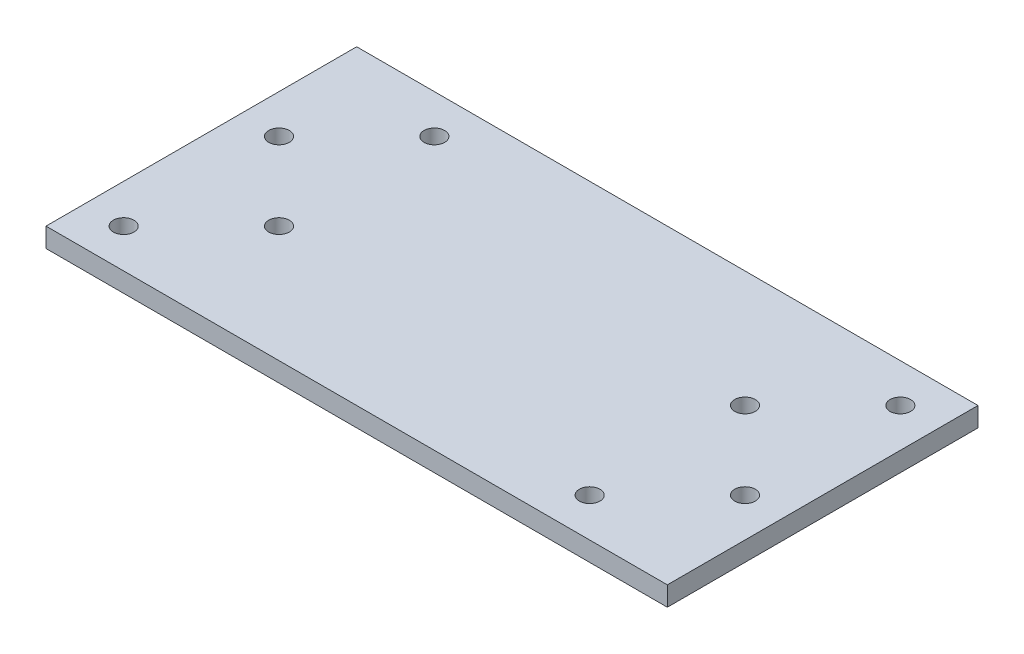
ISO-10303-21;
HEADER;
FILE_DESCRIPTION(('STEP AP214'),'2;1');
FILE_NAME('part.step','',(''),(''),'','','');
FILE_SCHEMA(('AUTOMOTIVE_DESIGN { 1 0 10303 214 1 1 1 1 }'));
ENDSEC;
DATA;
#1=APPLICATION_CONTEXT('core data for automotive mechanical design processes');
#2=APPLICATION_PROTOCOL_DEFINITION('international standard','automotive_design',2000,#1);
#3=PRODUCT_CONTEXT('',#1,'mechanical');
#4=PRODUCT('Part','Part','',(#3));
#5=PRODUCT_RELATED_PRODUCT_CATEGORY('part','',(#4));
#6=PRODUCT_DEFINITION_FORMATION('','',#4);
#7=PRODUCT_DEFINITION_CONTEXT('part definition',#1,'design');
#8=PRODUCT_DEFINITION('design','',#6,#7);
#9=PRODUCT_DEFINITION_SHAPE('','',#8);
#10=(LENGTH_UNIT() NAMED_UNIT(*) SI_UNIT(.MILLI.,.METRE.));
#11=(NAMED_UNIT(*) PLANE_ANGLE_UNIT() SI_UNIT($,.RADIAN.));
#12=(NAMED_UNIT(*) SI_UNIT($,.STERADIAN.) SOLID_ANGLE_UNIT());
#13=UNCERTAINTY_MEASURE_WITH_UNIT(LENGTH_MEASURE(1.E-05),#10,'distance_accuracy_value','');
#14=(GEOMETRIC_REPRESENTATION_CONTEXT(3) GLOBAL_UNCERTAINTY_ASSIGNED_CONTEXT((#13)) GLOBAL_UNIT_ASSIGNED_CONTEXT((#10,
#11,#12)) REPRESENTATION_CONTEXT('',''));
#15=CARTESIAN_POINT('',(0.,0.,0.));
#16=DIRECTION('',(0.,0.,1.));
#17=DIRECTION('',(1.,0.,0.));
#18=AXIS2_PLACEMENT_3D('',#15,#16,#17);
#19=CARTESIAN_POINT('',(0.,6.35,0.));
#20=DIRECTION('',(0.,-1.,0.));
#21=DIRECTION('',(0.,0.,-1.));
#22=AXIS2_PLACEMENT_3D('',#19,#20,#21);
#23=PLANE('',#22);
#24=CARTESIAN_POINT('',(190.5,6.35,-88.9));
#25=DIRECTION('',(0.,1.,0.));
#26=DIRECTION('',(0.,0.,1.));
#27=AXIS2_PLACEMENT_3D('',#24,#25,#26);
#28=CIRCLE('',#27,3.37312000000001);
#29=CARTESIAN_POINT('',(190.5,6.35,-85.52688));
#30=VERTEX_POINT('',#29);
#31=EDGE_CURVE('E170',#30,#30,#28,.T.);
#32=ORIENTED_EDGE('',*,*,#31,.F.);
#33=EDGE_LOOP('',(#32));
#34=FACE_BOUND('',#33,.T.);
#35=CARTESIAN_POINT('',(12.7,6.35,-63.5));
#36=DIRECTION('',(0.,1.,0.));
#37=DIRECTION('',(0.,0.,1.));
#38=AXIS2_PLACEMENT_3D('',#35,#36,#37);
#39=CIRCLE('',#38,3.37312);
#40=CARTESIAN_POINT('',(12.7,6.35,-60.12688));
#41=VERTEX_POINT('',#40);
#42=EDGE_CURVE('E182',#41,#41,#39,.T.);
#43=ORIENTED_EDGE('',*,*,#42,.F.);
#44=EDGE_LOOP('',(#43));
#45=FACE_BOUND('',#44,.T.);
#46=CARTESIAN_POINT('',(190.5,6.35,-38.1));
#47=DIRECTION('',(0.,1.,0.));
#48=DIRECTION('',(0.,0.,1.));
#49=AXIS2_PLACEMENT_3D('',#46,#47,#48);
#50=CIRCLE('',#49,3.37312000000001);
#51=CARTESIAN_POINT('',(190.5,6.35,-34.72688));
#52=VERTEX_POINT('',#51);
#53=EDGE_CURVE('E194',#52,#52,#50,.T.);
#54=ORIENTED_EDGE('',*,*,#53,.F.);
#55=EDGE_LOOP('',(#54));
#56=FACE_BOUND('',#55,.T.);
#57=CARTESIAN_POINT('',(12.7,6.35,-12.7));
#58=DIRECTION('',(0.,1.,0.));
#59=DIRECTION('',(0.,0.,1.));
#60=AXIS2_PLACEMENT_3D('',#57,#58,#59);
#61=CIRCLE('',#60,3.37312);
#62=CARTESIAN_POINT('',(12.7,6.35,-9.32688));
#63=VERTEX_POINT('',#62);
#64=EDGE_CURVE('E96',#63,#63,#61,.T.);
#65=ORIENTED_EDGE('',*,*,#64,.F.);
#66=EDGE_LOOP('',(#65));
#67=FACE_BOUND('',#66,.T.);
#68=DIRECTION('',(0.,0.,1.));
#69=VECTOR('',#68,1.);
#70=CARTESIAN_POINT('',(0.,6.35,0.));
#71=LINE('',#70,#69);
#72=CARTESIAN_POINT('',(0.,6.35,-101.6));
#73=VERTEX_POINT('',#72);
#74=CARTESIAN_POINT('',(0.,6.35,0.));
#75=VERTEX_POINT('',#74);
#76=EDGE_CURVE('E47',#73,#75,#71,.T.);
#77=ORIENTED_EDGE('',*,*,#76,.T.);
#78=DIRECTION('',(1.,0.,0.));
#79=VECTOR('',#78,1.);
#80=CARTESIAN_POINT('',(0.,6.35,0.));
#81=LINE('',#80,#79);
#82=CARTESIAN_POINT('',(203.2,6.35,0.));
#83=VERTEX_POINT('',#82);
#84=EDGE_CURVE('E77',#75,#83,#81,.T.);
#85=ORIENTED_EDGE('',*,*,#84,.T.);
#86=DIRECTION('',(0.,0.,-1.));
#87=VECTOR('',#86,1.);
#88=CARTESIAN_POINT('',(203.2,6.35,0.));
#89=LINE('',#88,#87);
#90=CARTESIAN_POINT('',(203.2,6.35,-101.6));
#91=VERTEX_POINT('',#90);
#92=EDGE_CURVE('E81',#83,#91,#89,.T.);
#93=ORIENTED_EDGE('',*,*,#92,.T.);
#94=DIRECTION('',(-1.,0.,0.));
#95=VECTOR('',#94,1.);
#96=CARTESIAN_POINT('',(203.2,6.35,-101.6));
#97=LINE('',#96,#95);
#98=EDGE_CURVE('E89',#91,#73,#97,.T.);
#99=ORIENTED_EDGE('',*,*,#98,.T.);
#100=EDGE_LOOP('',(#77,#85,#93,#99));
#101=FACE_BOUND('',#100,.T.);
#102=CARTESIAN_POINT('',(38.1,6.35,-38.1));
#103=DIRECTION('',(0.,1.,0.));
#104=DIRECTION('',(0.,0.,1.));
#105=AXIS2_PLACEMENT_3D('',#102,#103,#104);
#106=CIRCLE('',#105,3.37312);
#107=CARTESIAN_POINT('',(38.1,6.35,-34.72688));
#108=VERTEX_POINT('',#107);
#109=EDGE_CURVE('E200',#108,#108,#106,.T.);
#110=ORIENTED_EDGE('',*,*,#109,.F.);
#111=EDGE_LOOP('',(#110));
#112=FACE_BOUND('',#111,.T.);
#113=CARTESIAN_POINT('',(165.1,6.35,-12.7));
#114=DIRECTION('',(0.,1.,0.));
#115=DIRECTION('',(0.,0.,1.));
#116=AXIS2_PLACEMENT_3D('',#113,#114,#115);
#117=CIRCLE('',#116,3.37312000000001);
#118=CARTESIAN_POINT('',(165.1,6.35,-9.32687999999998));
#119=VERTEX_POINT('',#118);
#120=EDGE_CURVE('E188',#119,#119,#117,.T.);
#121=ORIENTED_EDGE('',*,*,#120,.F.);
#122=EDGE_LOOP('',(#121));
#123=FACE_BOUND('',#122,.T.);
#124=CARTESIAN_POINT('',(38.1,6.35,-88.9));
#125=DIRECTION('',(0.,1.,0.));
#126=DIRECTION('',(0.,0.,1.));
#127=AXIS2_PLACEMENT_3D('',#124,#125,#126);
#128=CIRCLE('',#127,3.37312);
#129=CARTESIAN_POINT('',(38.1,6.35,-85.52688));
#130=VERTEX_POINT('',#129);
#131=EDGE_CURVE('E176',#130,#130,#128,.T.);
#132=ORIENTED_EDGE('',*,*,#131,.F.);
#133=EDGE_LOOP('',(#132));
#134=FACE_BOUND('',#133,.T.);
#135=CARTESIAN_POINT('',(165.1,6.35,-63.5));
#136=DIRECTION('',(0.,1.,0.));
#137=DIRECTION('',(0.,0.,1.));
#138=AXIS2_PLACEMENT_3D('',#135,#136,#137);
#139=CIRCLE('',#138,3.37311999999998);
#140=CARTESIAN_POINT('',(165.1,6.35,-60.12688));
#141=VERTEX_POINT('',#140);
#142=EDGE_CURVE('E161',#141,#141,#139,.T.);
#143=ORIENTED_EDGE('',*,*,#142,.F.);
#144=EDGE_LOOP('',(#143));
#145=FACE_BOUND('',#144,.T.);
#146=ADVANCED_FACE('F30',(#34,#45,#56,#67,#101,#112,#123,#134,#145),#23,.F.);
#147=CARTESIAN_POINT('',(0.,0.,0.));
#148=DIRECTION('',(0.,-1.,0.));
#149=DIRECTION('',(0.,0.,-1.));
#150=AXIS2_PLACEMENT_3D('',#147,#148,#149);
#151=PLANE('',#150);
#152=CARTESIAN_POINT('',(190.5,0.,-88.9));
#153=DIRECTION('',(0.,1.,0.));
#154=DIRECTION('',(0.,0.,1.));
#155=AXIS2_PLACEMENT_3D('',#152,#153,#154);
#156=CIRCLE('',#155,3.37312000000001);
#157=CARTESIAN_POINT('',(190.5,0.,-85.52688));
#158=VERTEX_POINT('',#157);
#159=EDGE_CURVE('E167',#158,#158,#156,.T.);
#160=ORIENTED_EDGE('',*,*,#159,.T.);
#161=EDGE_LOOP('',(#160));
#162=FACE_BOUND('',#161,.T.);
#163=CARTESIAN_POINT('',(12.7,0.,-63.5));
#164=DIRECTION('',(0.,1.,0.));
#165=DIRECTION('',(0.,0.,1.));
#166=AXIS2_PLACEMENT_3D('',#163,#164,#165);
#167=CIRCLE('',#166,3.37312);
#168=CARTESIAN_POINT('',(12.7,0.,-60.12688));
#169=VERTEX_POINT('',#168);
#170=EDGE_CURVE('E179',#169,#169,#167,.T.);
#171=ORIENTED_EDGE('',*,*,#170,.T.);
#172=EDGE_LOOP('',(#171));
#173=FACE_BOUND('',#172,.T.);
#174=CARTESIAN_POINT('',(190.5,0.,-38.1));
#175=DIRECTION('',(0.,1.,0.));
#176=DIRECTION('',(0.,0.,1.));
#177=AXIS2_PLACEMENT_3D('',#174,#175,#176);
#178=CIRCLE('',#177,3.37312000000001);
#179=CARTESIAN_POINT('',(190.5,0.,-34.72688));
#180=VERTEX_POINT('',#179);
#181=EDGE_CURVE('E191',#180,#180,#178,.T.);
#182=ORIENTED_EDGE('',*,*,#181,.T.);
#183=EDGE_LOOP('',(#182));
#184=FACE_BOUND('',#183,.T.);
#185=CARTESIAN_POINT('',(12.7,0.,-12.7));
#186=DIRECTION('',(0.,1.,0.));
#187=DIRECTION('',(0.,0.,1.));
#188=AXIS2_PLACEMENT_3D('',#185,#186,#187);
#189=CIRCLE('',#188,3.37312);
#190=CARTESIAN_POINT('',(12.7,0.,-9.32688));
#191=VERTEX_POINT('',#190);
#192=EDGE_CURVE('E203',#191,#191,#189,.T.);
#193=ORIENTED_EDGE('',*,*,#192,.T.);
#194=EDGE_LOOP('',(#193));
#195=FACE_BOUND('',#194,.T.);
#196=DIRECTION('',(1.,0.,0.));
#197=VECTOR('',#196,1.);
#198=CARTESIAN_POINT('',(0.,0.,0.));
#199=LINE('',#198,#197);
#200=CARTESIAN_POINT('',(0.,0.,0.));
#201=VERTEX_POINT('',#200);
#202=CARTESIAN_POINT('',(203.2,0.,0.));
#203=VERTEX_POINT('',#202);
#204=EDGE_CURVE('E85',#201,#203,#199,.T.);
#205=ORIENTED_EDGE('',*,*,#204,.F.);
#206=DIRECTION('',(0.,0.,1.));
#207=VECTOR('',#206,1.);
#208=CARTESIAN_POINT('',(0.,0.,-50.8));
#209=LINE('',#208,#207);
#210=CARTESIAN_POINT('',(0.,0.,-101.6));
#211=VERTEX_POINT('',#210);
#212=EDGE_CURVE('E99',#211,#201,#209,.T.);
#213=ORIENTED_EDGE('',*,*,#212,.F.);
#214=DIRECTION('',(-1.,0.,0.));
#215=VECTOR('',#214,1.);
#216=CARTESIAN_POINT('',(203.2,0.,-101.6));
#217=LINE('',#216,#215);
#218=CARTESIAN_POINT('',(203.2,0.,-101.6));
#219=VERTEX_POINT('',#218);
#220=EDGE_CURVE('E71',#219,#211,#217,.T.);
#221=ORIENTED_EDGE('',*,*,#220,.F.);
#222=DIRECTION('',(0.,0.,-1.));
#223=VECTOR('',#222,1.);
#224=CARTESIAN_POINT('',(203.2,0.,-50.8));
#225=LINE('',#224,#223);
#226=EDGE_CURVE('E64',#203,#219,#225,.T.);
#227=ORIENTED_EDGE('',*,*,#226,.F.);
#228=EDGE_LOOP('',(#205,#213,#221,#227));
#229=FACE_BOUND('',#228,.T.);
#230=CARTESIAN_POINT('',(38.1,0.,-38.1));
#231=DIRECTION('',(0.,1.,0.));
#232=DIRECTION('',(0.,0.,1.));
#233=AXIS2_PLACEMENT_3D('',#230,#231,#232);
#234=CIRCLE('',#233,3.37312);
#235=CARTESIAN_POINT('',(38.1,0.,-34.72688));
#236=VERTEX_POINT('',#235);
#237=EDGE_CURVE('E197',#236,#236,#234,.T.);
#238=ORIENTED_EDGE('',*,*,#237,.T.);
#239=EDGE_LOOP('',(#238));
#240=FACE_BOUND('',#239,.T.);
#241=CARTESIAN_POINT('',(165.1,0.,-12.7));
#242=DIRECTION('',(0.,1.,0.));
#243=DIRECTION('',(0.,0.,1.));
#244=AXIS2_PLACEMENT_3D('',#241,#242,#243);
#245=CIRCLE('',#244,3.37312000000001);
#246=CARTESIAN_POINT('',(165.1,0.,-9.32687999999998));
#247=VERTEX_POINT('',#246);
#248=EDGE_CURVE('E185',#247,#247,#245,.T.);
#249=ORIENTED_EDGE('',*,*,#248,.T.);
#250=EDGE_LOOP('',(#249));
#251=FACE_BOUND('',#250,.T.);
#252=CARTESIAN_POINT('',(38.1,0.,-88.9));
#253=DIRECTION('',(0.,1.,0.));
#254=DIRECTION('',(0.,0.,1.));
#255=AXIS2_PLACEMENT_3D('',#252,#253,#254);
#256=CIRCLE('',#255,3.37312);
#257=CARTESIAN_POINT('',(38.1,0.,-85.52688));
#258=VERTEX_POINT('',#257);
#259=EDGE_CURVE('E173',#258,#258,#256,.T.);
#260=ORIENTED_EDGE('',*,*,#259,.T.);
#261=EDGE_LOOP('',(#260));
#262=FACE_BOUND('',#261,.T.);
#263=CARTESIAN_POINT('',(165.1,0.,-63.5));
#264=DIRECTION('',(0.,1.,0.));
#265=DIRECTION('',(0.,0.,1.));
#266=AXIS2_PLACEMENT_3D('',#263,#264,#265);
#267=CIRCLE('',#266,3.37311999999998);
#268=CARTESIAN_POINT('',(165.1,0.,-60.12688));
#269=VERTEX_POINT('',#268);
#270=EDGE_CURVE('E164',#269,#269,#267,.T.);
#271=ORIENTED_EDGE('',*,*,#270,.T.);
#272=EDGE_LOOP('',(#271));
#273=FACE_BOUND('',#272,.T.);
#274=ADVANCED_FACE('F105',(#162,#173,#184,#195,#229,#240,#251,#262,#273),#151,.T.);
#275=CARTESIAN_POINT('',(0.,6.35,0.));
#276=DIRECTION('',(0.,0.,-1.));
#277=DIRECTION('',(-1.,0.,0.));
#278=AXIS2_PLACEMENT_3D('',#275,#276,#277);
#279=PLANE('',#278);
#280=ORIENTED_EDGE('',*,*,#204,.T.);
#281=DIRECTION('',(0.,-1.,0.));
#282=VECTOR('',#281,1.);
#283=CARTESIAN_POINT('',(203.2,6.35,0.));
#284=LINE('',#283,#282);
#285=EDGE_CURVE('E39',#83,#203,#284,.T.);
#286=ORIENTED_EDGE('',*,*,#285,.F.);
#287=ORIENTED_EDGE('',*,*,#84,.F.);
#288=DIRECTION('',(0.,-1.,0.));
#289=VECTOR('',#288,1.);
#290=CARTESIAN_POINT('',(0.,6.35,0.));
#291=LINE('',#290,#289);
#292=EDGE_CURVE('E11',#75,#201,#291,.T.);
#293=ORIENTED_EDGE('',*,*,#292,.T.);
#294=EDGE_LOOP('',(#280,#286,#287,#293));
#295=FACE_BOUND('',#294,.T.);
#296=ADVANCED_FACE('F32',(#295),#279,.F.);
#297=CARTESIAN_POINT('',(203.2,6.35,-50.8));
#298=DIRECTION('',(-1.,0.,0.));
#299=DIRECTION('',(0.,0.,1.));
#300=AXIS2_PLACEMENT_3D('',#297,#298,#299);
#301=PLANE('',#300);
#302=ORIENTED_EDGE('',*,*,#226,.T.);
#303=DIRECTION('',(0.,-1.,0.));
#304=VECTOR('',#303,1.);
#305=CARTESIAN_POINT('',(203.2,6.35,-101.6));
#306=LINE('',#305,#304);
#307=EDGE_CURVE('E86',#91,#219,#306,.T.);
#308=ORIENTED_EDGE('',*,*,#307,.F.);
#309=ORIENTED_EDGE('',*,*,#92,.F.);
#310=ORIENTED_EDGE('',*,*,#285,.T.);
#311=EDGE_LOOP('',(#302,#308,#309,#310));
#312=FACE_BOUND('',#311,.T.);
#313=ADVANCED_FACE('F87',(#312),#301,.F.);
#314=CARTESIAN_POINT('',(203.2,6.35,-101.6));
#315=DIRECTION('',(0.,0.,1.));
#316=DIRECTION('',(1.,0.,0.));
#317=AXIS2_PLACEMENT_3D('',#314,#315,#316);
#318=PLANE('',#317);
#319=ORIENTED_EDGE('',*,*,#220,.T.);
#320=DIRECTION('',(0.,-1.,0.));
#321=VECTOR('',#320,1.);
#322=CARTESIAN_POINT('',(0.,6.35,-101.6));
#323=LINE('',#322,#321);
#324=EDGE_CURVE('E91',#73,#211,#323,.T.);
#325=ORIENTED_EDGE('',*,*,#324,.F.);
#326=ORIENTED_EDGE('',*,*,#98,.F.);
#327=ORIENTED_EDGE('',*,*,#307,.T.);
#328=EDGE_LOOP('',(#319,#325,#326,#327));
#329=FACE_BOUND('',#328,.T.);
#330=ADVANCED_FACE('F102',(#329),#318,.F.);
#331=CARTESIAN_POINT('',(0.,6.35,-50.8));
#332=DIRECTION('',(1.,0.,0.));
#333=DIRECTION('',(0.,0.,-1.));
#334=AXIS2_PLACEMENT_3D('',#331,#332,#333);
#335=PLANE('',#334);
#336=ORIENTED_EDGE('',*,*,#212,.T.);
#337=ORIENTED_EDGE('',*,*,#292,.F.);
#338=ORIENTED_EDGE('',*,*,#76,.F.);
#339=ORIENTED_EDGE('',*,*,#324,.T.);
#340=EDGE_LOOP('',(#336,#337,#338,#339));
#341=FACE_BOUND('',#340,.T.);
#342=ADVANCED_FACE('F107',(#341),#335,.F.);
#343=CARTESIAN_POINT('',(12.7,6.35,-12.7));
#344=DIRECTION('',(0.,-1.,0.));
#345=DIRECTION('',(0.,0.,-1.));
#346=AXIS2_PLACEMENT_3D('',#343,#344,#345);
#347=CYLINDRICAL_SURFACE('',#346,3.37312);
#348=ORIENTED_EDGE('',*,*,#64,.T.);
#349=EDGE_LOOP('',(#348));
#350=FACE_BOUND('',#349,.T.);
#351=ORIENTED_EDGE('',*,*,#192,.F.);
#352=EDGE_LOOP('',(#351));
#353=FACE_BOUND('',#352,.T.);
#354=ADVANCED_FACE('F109',(#350,#353),#347,.F.);
#355=CARTESIAN_POINT('',(38.1,6.35,-38.1));
#356=DIRECTION('',(0.,-1.,0.));
#357=DIRECTION('',(0.,0.,-1.));
#358=AXIS2_PLACEMENT_3D('',#355,#356,#357);
#359=CYLINDRICAL_SURFACE('',#358,3.37312);
#360=ORIENTED_EDGE('',*,*,#109,.T.);
#361=EDGE_LOOP('',(#360));
#362=FACE_BOUND('',#361,.T.);
#363=ORIENTED_EDGE('',*,*,#237,.F.);
#364=EDGE_LOOP('',(#363));
#365=FACE_BOUND('',#364,.T.);
#366=ADVANCED_FACE('F115',(#362,#365),#359,.F.);
#367=CARTESIAN_POINT('',(190.5,6.35,-38.1));
#368=DIRECTION('',(0.,-1.,0.));
#369=DIRECTION('',(0.,0.,-1.));
#370=AXIS2_PLACEMENT_3D('',#367,#368,#369);
#371=CYLINDRICAL_SURFACE('',#370,3.37312000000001);
#372=ORIENTED_EDGE('',*,*,#53,.T.);
#373=EDGE_LOOP('',(#372));
#374=FACE_BOUND('',#373,.T.);
#375=ORIENTED_EDGE('',*,*,#181,.F.);
#376=EDGE_LOOP('',(#375));
#377=FACE_BOUND('',#376,.T.);
#378=ADVANCED_FACE('F132',(#374,#377),#371,.F.);
#379=CARTESIAN_POINT('',(165.1,6.35,-12.7));
#380=DIRECTION('',(0.,-1.,0.));
#381=DIRECTION('',(0.,0.,-1.));
#382=AXIS2_PLACEMENT_3D('',#379,#380,#381);
#383=CYLINDRICAL_SURFACE('',#382,3.37312000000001);
#384=ORIENTED_EDGE('',*,*,#120,.T.);
#385=EDGE_LOOP('',(#384));
#386=FACE_BOUND('',#385,.T.);
#387=ORIENTED_EDGE('',*,*,#248,.F.);
#388=EDGE_LOOP('',(#387));
#389=FACE_BOUND('',#388,.T.);
#390=ADVANCED_FACE('F136',(#386,#389),#383,.F.);
#391=CARTESIAN_POINT('',(12.7,6.35,-63.5));
#392=DIRECTION('',(0.,-1.,0.));
#393=DIRECTION('',(0.,0.,-1.));
#394=AXIS2_PLACEMENT_3D('',#391,#392,#393);
#395=CYLINDRICAL_SURFACE('',#394,3.37312);
#396=ORIENTED_EDGE('',*,*,#42,.T.);
#397=EDGE_LOOP('',(#396));
#398=FACE_BOUND('',#397,.T.);
#399=ORIENTED_EDGE('',*,*,#170,.F.);
#400=EDGE_LOOP('',(#399));
#401=FACE_BOUND('',#400,.T.);
#402=ADVANCED_FACE('F140',(#398,#401),#395,.F.);
#403=CARTESIAN_POINT('',(38.1,6.35,-88.9));
#404=DIRECTION('',(0.,-1.,0.));
#405=DIRECTION('',(0.,0.,-1.));
#406=AXIS2_PLACEMENT_3D('',#403,#404,#405);
#407=CYLINDRICAL_SURFACE('',#406,3.37312);
#408=ORIENTED_EDGE('',*,*,#131,.T.);
#409=EDGE_LOOP('',(#408));
#410=FACE_BOUND('',#409,.T.);
#411=ORIENTED_EDGE('',*,*,#259,.F.);
#412=EDGE_LOOP('',(#411));
#413=FACE_BOUND('',#412,.T.);
#414=ADVANCED_FACE('F144',(#410,#413),#407,.F.);
#415=CARTESIAN_POINT('',(190.5,6.35,-88.9));
#416=DIRECTION('',(0.,-1.,0.));
#417=DIRECTION('',(0.,0.,-1.));
#418=AXIS2_PLACEMENT_3D('',#415,#416,#417);
#419=CYLINDRICAL_SURFACE('',#418,3.37312000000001);
#420=ORIENTED_EDGE('',*,*,#31,.T.);
#421=EDGE_LOOP('',(#420));
#422=FACE_BOUND('',#421,.T.);
#423=ORIENTED_EDGE('',*,*,#159,.F.);
#424=EDGE_LOOP('',(#423));
#425=FACE_BOUND('',#424,.T.);
#426=ADVANCED_FACE('F148',(#422,#425),#419,.F.);
#427=CARTESIAN_POINT('',(165.1,6.35,-63.5));
#428=DIRECTION('',(0.,-1.,0.));
#429=DIRECTION('',(0.,0.,-1.));
#430=AXIS2_PLACEMENT_3D('',#427,#428,#429);
#431=CYLINDRICAL_SURFACE('',#430,3.37311999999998);
#432=ORIENTED_EDGE('',*,*,#142,.T.);
#433=EDGE_LOOP('',(#432));
#434=FACE_BOUND('',#433,.T.);
#435=ORIENTED_EDGE('',*,*,#270,.F.);
#436=EDGE_LOOP('',(#435));
#437=FACE_BOUND('',#436,.T.);
#438=ADVANCED_FACE('F152',(#434,#437),#431,.F.);
#439=CLOSED_SHELL('',(#146,#274,#296,#313,#330,#342,#354,#366,#378,#390,#402,#414,#426,#438));
#440=MANIFOLD_SOLID_BREP('B2',#439);
#441=ADVANCED_BREP_SHAPE_REPRESENTATION('',(#18,#440),#14);
#442=SHAPE_DEFINITION_REPRESENTATION(#9,#441);
ENDSEC;
END-ISO-10303-21;
